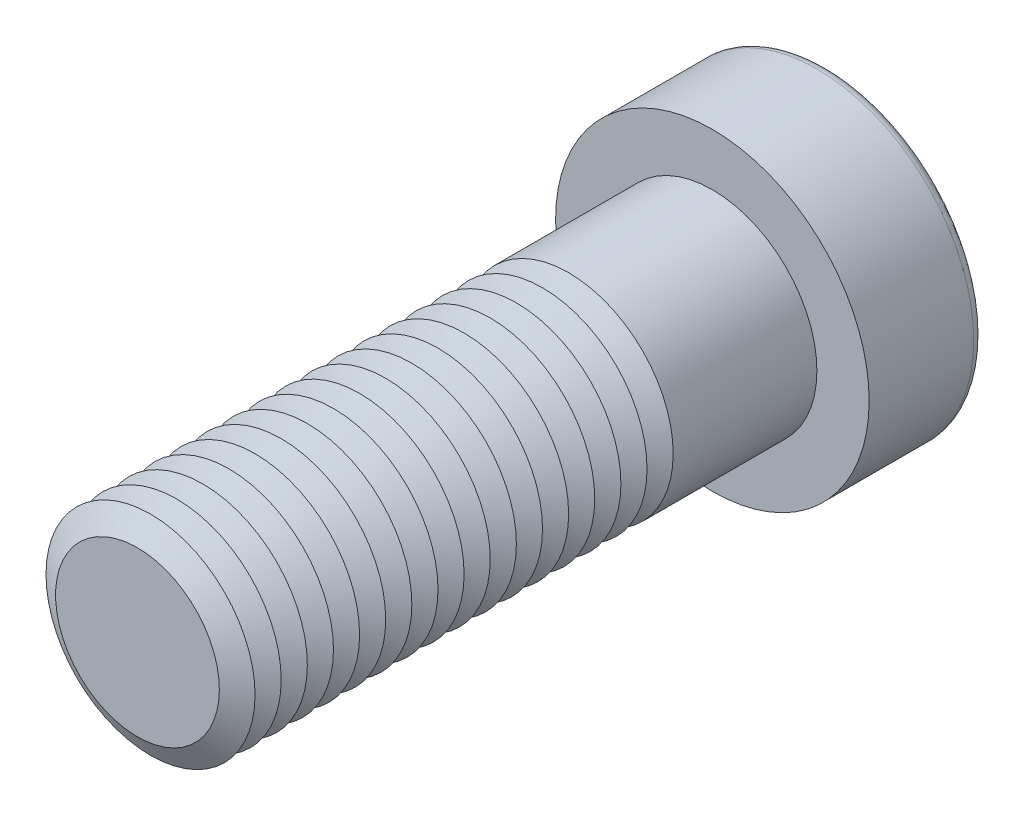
from build123d import *

# Parameters (mm, degrees)
SKETCH1_R           = 10
BOSS_EXTRUDE1_DEPTH = 55
SKETCH2_R           = 15
BOSS_EXTRUDE2_DEPTH = 11
CUT_EXTRUDE1_DEPTH  = 10.5
FILLET1_R           = 1
LPATTERN1_COUNT     = 17
LPATTERN1_PITCH     = 2.5


with BuildPart() as part:
    # Sketch1 → Boss-Extrude1 (new body)
    with BuildSketch(Plane.XY):
        Circle(SKETCH1_R)
    extrude(amount=BOSS_EXTRUDE1_DEPTH)

    # Sketch2 → Boss-Extrude2 (add)
    with BuildSketch(Plane(origin=(0, 0, 0), x_dir=(-1, 0, 0), z_dir=(0, 0, -1))):
        Circle(SKETCH2_R)
    extrude(amount=BOSS_EXTRUDE2_DEPTH)

    # Sketch3 → Cut-Extrude1 (cut)
    with BuildSketch(Plane(origin=(0, 0, -11), x_dir=(-1, 0, 0), z_dir=(0, 0, -1))):
        Polygon((-4.041451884, 7), (-8.082903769, 0), (-4.041451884, -7), (4.041451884, -7), (8.082903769, 0), (4.041451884, 7), align=None)
    extrude(amount=-CUT_EXTRUDE1_DEPTH, mode=Mode.SUBTRACT)

    # Fillet1
    fillet1_edges = [part.edges().sort_by_distance(p)[0] for p in [
        (15, 0, -11),
    ]]
    fillet(fillet1_edges, radius=FILLET1_R)

    # Cut-Extrude2 cone 1 section (on through the dimple's axis) → Cut-Extrude2 (revolve, cut)
    with BuildSketch(Plane(origin=(0, 0, -0.5), x_dir=(0, 1, 0), z_dir=(1, 0, 0))):
        Polygon((0, 0), (7, 0), (0, 4.041451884), align=None)
    revolve(axis=Axis((0, 0, -0.5), (0, 0, 1)), mode=Mode.SUBTRACT)

    # Cut-Extrude3 cone 1 section (on through the dimple's axis) → Cut-Extrude3 (revolve, cut)
    with BuildSketch(Plane(origin=(0, 0, -11), x_dir=(0, 1, 0), z_dir=(1, 0, 0))):
        Polygon((0, 0), (8.082903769, 0), (0, 2.165807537), align=None)
    revolve(axis=Axis((0, 0, -11), (0, 0, 1)), mode=Mode.SUBTRACT)

    # Sketch7 → Cut-Revolve1 (revolve, cut)
    with BuildSketch(Plane(origin=(0, 0, 0), x_dir=(0, 0, -1), z_dir=(1, 0, 0)), mode=Mode.PRIVATE) as cut_revolve1_sk:
        Polygon((-55, 7.834936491), (-53.75, 10), (-56.25, 10), align=None)
    cut_revolve1 = revolve(cut_revolve1_sk.sketch.rotate(Axis((0, 0, 55), (0, 0, -1)), 90), axis=Axis((0, 0, 55), (0, 0, -1)), mode=Mode.SUBTRACT)

    # LPattern1: Cut-Revolve1 ×17
    with Locations(*[(0, 0, -i * LPATTERN1_PITCH) for i in range(1, LPATTERN1_COUNT)]):
        add(cut_revolve1, mode=Mode.SUBTRACT)


solid = part.part
